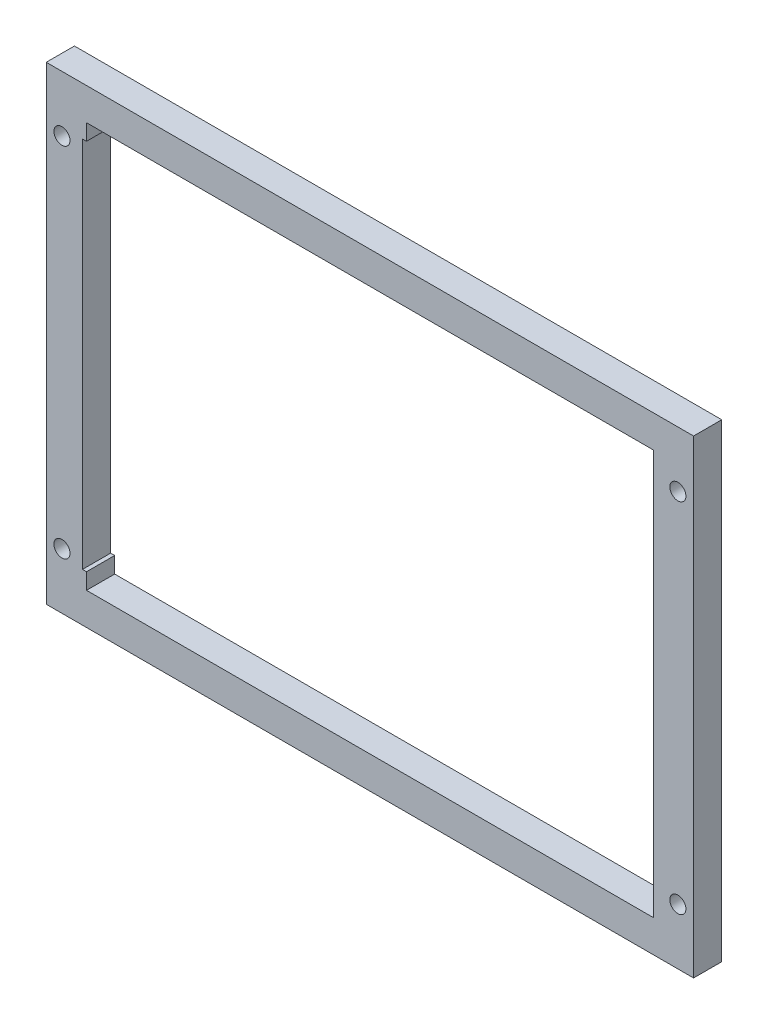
from build123d import *

# Parameters (mm, degrees)
ESQUISSE1_W        = 80.4
ESQUISSE1_H        = 58.3
ESQUISSE1_R        = 1
BOSS_EXTRU_1_DEPTH = 3.5


with BuildPart() as part:
    # Esquisse1 → Boss.-Extru.1 (new body)
    with BuildSketch(Plane.XY):
        Rectangle(ESQUISSE1_W, ESQUISSE1_H)
        with Locations((-38.25, 22.2)):
            Circle(ESQUISSE1_R, mode=Mode.SUBTRACT)
        with Locations((-38.25, -22.2)):
            Circle(ESQUISSE1_R, mode=Mode.SUBTRACT)
        with Locations((38.25, 22.2)):
            Circle(ESQUISSE1_R, mode=Mode.SUBTRACT)
        with Locations((38.25, -22.2)):
            Circle(ESQUISSE1_R, mode=Mode.SUBTRACT)
        Polygon((-35.2, 25.15), (35.2, 25.15), (35.2, -25.15), (-35.2, -25.15), (-35.2, -23.15), (-35.7, -23.15), (-35.7, 23.15), (-35.2, 23.15), align=None, mode=Mode.SUBTRACT)
    extrude(amount=BOSS_EXTRU_1_DEPTH)


solid = part.part
